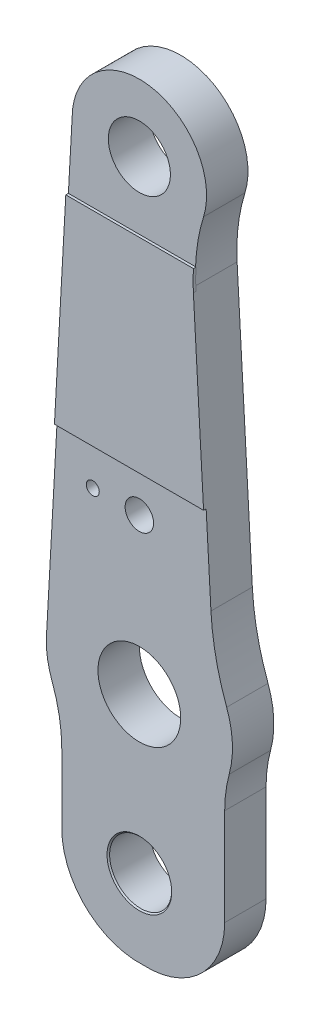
from build123d import *

# Parameters (mm, degrees)
ESQUISSE1_R             = 5.5
ESQUISSE1_R_2           = 12
BASE_EXTRUSION_DEPTH    = 16
BOSS_EXTRU_1_DEPTH      = 1
CHANFREIN1_SIZE         = 0.5
ESQUISSE5_R             = 16
ENL_V_MAT_EXTRU_3_DEPTH = 273.858937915
ESQUISSE4_R             = 2.5
ENL_V_MAT_EXTRU_4_DEPTH = 273.858937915


with BuildPart() as part:
    # Esquisse1 → Base-Extrusion (new body)
    with BuildSketch(Plane.XY):
        with BuildLine():
            Line((21.796120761, -32.33017369), (27.683346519, -138.300237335))
            ThreePointArc((27.683346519, -138.300237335), (29.626321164, -153.124556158), (33.757777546, -167.493503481))
            ThreePointArc((33.757777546, -167.493503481), (35.963644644, -178.382513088), (34.744186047, -189.425578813))
            ThreePointArc((34.744186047, -189.425578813), (33.437964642, -195.913278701), (33, -202.516660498))
            Line((33, -202.516660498), (33, -240))
            ThreePointArc((33, -240), (23.676073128, -261.737065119), (1.5, -269.962476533))
            ThreePointArc((1.5, -269.962476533), (-20.676073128, -261.737065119), (-30, -240))
            Line((-30, -240), (-30, -213.406586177))
            ThreePointArc((-30, -213.406586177), (-30.944940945, -202.799984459), (-33.75, -192.527469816))
            ThreePointArc((-33.75, -192.527469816), (-35.731490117, -184.388691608), (-35.778461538, -176.012307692))
            Line((-35.778461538, -176.012307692), (-26, 0))
            ThreePointArc((-26, 0), (3.89623112, 25.706407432), (24.832260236, -7.704469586))
            ThreePointArc((24.832260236, -7.704469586), (22.214383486, -19.881724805), (21.796120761, -32.33017369))
        make_face()
        with Locations((0, -120)):
            Circle(ESQUISSE1_R, mode=Mode.SUBTRACT)
        Circle(ESQUISSE1_R_2, mode=Mode.SUBTRACT)
        with Locations((0, -240)):
            Circle(ESQUISSE1_R_2, mode=Mode.SUBTRACT)
    extrude(amount=BASE_EXTRUSION_DEPTH)

    # Esquisse2 → Boss.-Extru.1 (add)
    with BuildSketch(Plane.XY.offset(16)):
        with BuildLine():
            Line((-27.444444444, -26), (21.918077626, -26))
            ThreePointArc((21.918077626, -26), (21.788955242, -30.068042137), (21.896484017, -34.13671231))
            Line((21.896484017, -34.13671231), (25.833333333, -105))
            Line((25.833333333, -105), (-31.833333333, -105))
            Line((-31.833333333, -105), (-27.444444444, -26))
        make_face()
    extrude(amount=BOSS_EXTRU_1_DEPTH)

    # Chanfrein1
    chanfrein1_edges = [part.edges().sort_by_distance(p)[0] for p in [
        (-12, -240, 16),
    ]]
    chamfer(chanfrein1_edges, length=CHANFREIN1_SIZE)

    # Esquisse5 → Enl_v. mat.-Extru.3 (cut, through all)
    with BuildSketch(Plane.XY.offset(16)):
        with Locations((0, -180)):
            Circle(ESQUISSE5_R)
    extrude(amount=-ENL_V_MAT_EXTRU_3_DEPTH, mode=Mode.SUBTRACT)

    # Esquisse4 → Enl_v. mat.-Extru.4 (cut, through all)
    with BuildSketch(Plane.XY.offset(16)):
        with Locations((-18, -120)):
            Circle(ESQUISSE4_R)
    extrude(amount=-ENL_V_MAT_EXTRU_4_DEPTH, mode=Mode.SUBTRACT)


solid = part.part
